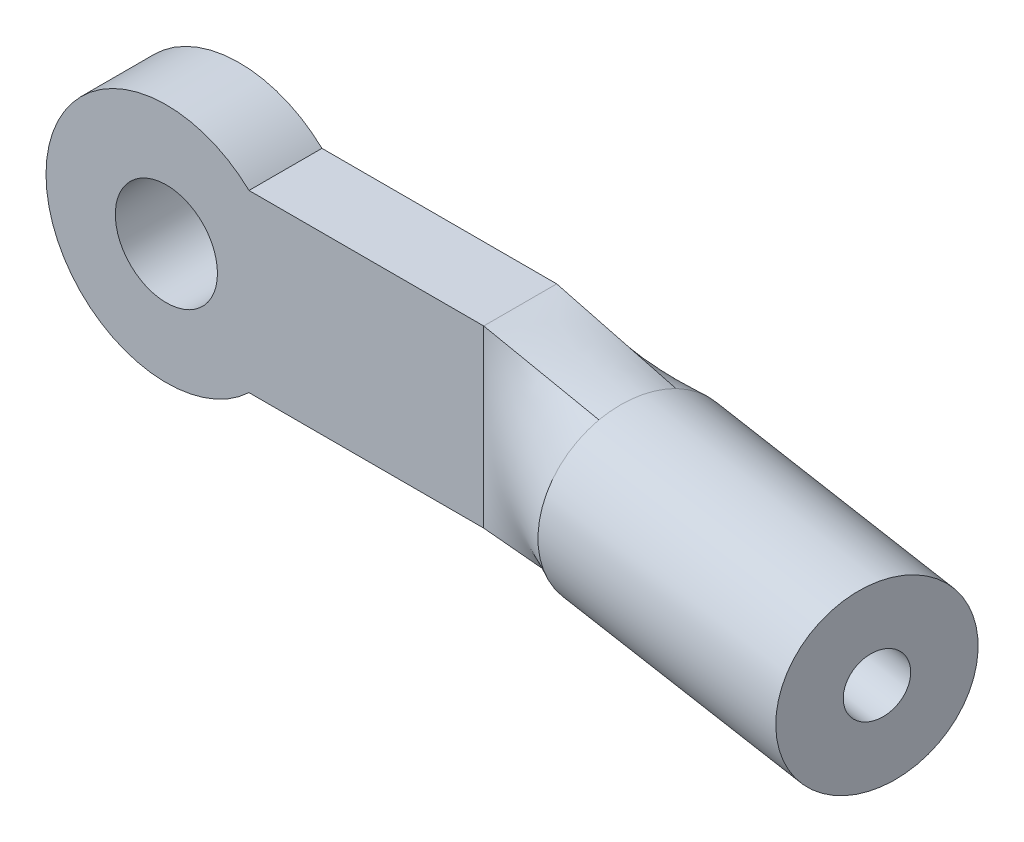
ISO-10303-21;
HEADER;
FILE_DESCRIPTION(('STEP AP214'),'2;1');
FILE_NAME('part.step','',(''),(''),'','','');
FILE_SCHEMA(('AUTOMOTIVE_DESIGN { 1 0 10303 214 1 1 1 1 }'));
ENDSEC;
DATA;
#1=APPLICATION_CONTEXT('core data for automotive mechanical design processes');
#2=APPLICATION_PROTOCOL_DEFINITION('international standard','automotive_design',2000,#1);
#3=PRODUCT_CONTEXT('',#1,'mechanical');
#4=PRODUCT('Part','Part','',(#3));
#5=PRODUCT_RELATED_PRODUCT_CATEGORY('part','',(#4));
#6=PRODUCT_DEFINITION_FORMATION('','',#4);
#7=PRODUCT_DEFINITION_CONTEXT('part definition',#1,'design');
#8=PRODUCT_DEFINITION('design','',#6,#7);
#9=PRODUCT_DEFINITION_SHAPE('','',#8);
#10=(LENGTH_UNIT() NAMED_UNIT(*) SI_UNIT(.MILLI.,.METRE.));
#11=(NAMED_UNIT(*) PLANE_ANGLE_UNIT() SI_UNIT($,.RADIAN.));
#12=(NAMED_UNIT(*) SI_UNIT($,.STERADIAN.) SOLID_ANGLE_UNIT());
#13=UNCERTAINTY_MEASURE_WITH_UNIT(LENGTH_MEASURE(1.E-05),#10,'distance_accuracy_value','');
#14=(GEOMETRIC_REPRESENTATION_CONTEXT(3) GLOBAL_UNCERTAINTY_ASSIGNED_CONTEXT((#13)) GLOBAL_UNIT_ASSIGNED_CONTEXT((#10,
#11,#12)) REPRESENTATION_CONTEXT('',''));
#15=CARTESIAN_POINT('',(0.,0.,0.));
#16=DIRECTION('',(0.,0.,1.));
#17=DIRECTION('',(1.,0.,0.));
#18=AXIS2_PLACEMENT_3D('',#15,#16,#17);
#19=CARTESIAN_POINT('',(0.,0.,0.5));
#20=DIRECTION('',(0.,0.,-1.));
#21=DIRECTION('',(-1.,0.,0.));
#22=AXIS2_PLACEMENT_3D('',#19,#20,#21);
#23=CYLINDRICAL_SURFACE('',#22,1.65);
#24=CARTESIAN_POINT('',(0.,0.,-0.5));
#25=DIRECTION('',(0.,0.,1.));
#26=DIRECTION('',(1.,0.,0.));
#27=AXIS2_PLACEMENT_3D('',#24,#25,#26);
#28=CIRCLE('',#27,1.65);
#29=CARTESIAN_POINT('',(1.13247516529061,1.2,-0.5));
#30=VERTEX_POINT('',#29);
#31=CARTESIAN_POINT('',(1.13247516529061,-1.2,-0.5));
#32=VERTEX_POINT('',#31);
#33=EDGE_CURVE('E117',#30,#32,#28,.T.);
#34=ORIENTED_EDGE('',*,*,#33,.T.);
#35=DIRECTION('',(0.,0.,-1.));
#36=VECTOR('',#35,1.);
#37=CARTESIAN_POINT('',(1.13247516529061,-1.2,0.5));
#38=LINE('',#37,#36);
#39=CARTESIAN_POINT('',(1.13247516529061,-1.2,0.5));
#40=VERTEX_POINT('',#39);
#41=EDGE_CURVE('E12',#40,#32,#38,.T.);
#42=ORIENTED_EDGE('',*,*,#41,.F.);
#43=CARTESIAN_POINT('',(0.,0.,0.5));
#44=DIRECTION('',(0.,0.,1.));
#45=DIRECTION('',(1.,0.,0.));
#46=AXIS2_PLACEMENT_3D('',#43,#44,#45);
#47=CIRCLE('',#46,1.65);
#48=CARTESIAN_POINT('',(1.13247516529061,1.2,0.5));
#49=VERTEX_POINT('',#48);
#50=EDGE_CURVE('E105',#49,#40,#47,.T.);
#51=ORIENTED_EDGE('',*,*,#50,.F.);
#52=DIRECTION('',(0.,0.,-1.));
#53=VECTOR('',#52,1.);
#54=CARTESIAN_POINT('',(1.13247516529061,1.2,0.5));
#55=LINE('',#54,#53);
#56=EDGE_CURVE('E79',#49,#30,#55,.T.);
#57=ORIENTED_EDGE('',*,*,#56,.T.);
#58=EDGE_LOOP('',(#34,#42,#51,#57));
#59=FACE_BOUND('',#58,.T.);
#60=ADVANCED_FACE('F60',(#59),#23,.T.);
#61=CARTESIAN_POINT('',(1.20740101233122,-1.2,0.5));
#62=DIRECTION('',(0.,-1.,0.));
#63=DIRECTION('',(1.,0.,0.));
#64=AXIS2_PLACEMENT_3D('',#61,#62,#63);
#65=PLANE('',#64);
#66=DIRECTION('',(-1.,0.,0.));
#67=VECTOR('',#66,1.);
#68=CARTESIAN_POINT('',(1.20740101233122,-1.2,-0.5));
#69=LINE('',#68,#67);
#70=CARTESIAN_POINT('',(4.34999999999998,-1.2,-0.500000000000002));
#71=VERTEX_POINT('',#70);
#72=EDGE_CURVE('E125',#71,#32,#69,.T.);
#73=ORIENTED_EDGE('',*,*,#72,.F.);
#74=DIRECTION('',(0.,0.,1.));
#75=VECTOR('',#74,1.);
#76=CARTESIAN_POINT('',(4.35,-1.2,0.5));
#77=LINE('',#76,#75);
#78=CARTESIAN_POINT('',(4.35000000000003,-1.2,0.500000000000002));
#79=VERTEX_POINT('',#78);
#80=EDGE_CURVE('E70',#79,#71,#77,.F.);
#81=ORIENTED_EDGE('',*,*,#80,.F.);
#82=DIRECTION('',(-1.,0.,0.));
#83=VECTOR('',#82,1.);
#84=CARTESIAN_POINT('',(1.20740101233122,-1.2,0.5));
#85=LINE('',#84,#83);
#86=EDGE_CURVE('E109',#79,#40,#85,.T.);
#87=ORIENTED_EDGE('',*,*,#86,.T.);
#88=ORIENTED_EDGE('',*,*,#41,.T.);
#89=EDGE_LOOP('',(#73,#81,#87,#88));
#90=FACE_BOUND('',#89,.T.);
#91=ADVANCED_FACE('F119',(#90),#65,.T.);
#92=CARTESIAN_POINT('',(1.20740101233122,1.2,0.5));
#93=DIRECTION('',(0.,1.,0.));
#94=DIRECTION('',(-1.,0.,0.));
#95=AXIS2_PLACEMENT_3D('',#92,#93,#94);
#96=PLANE('',#95);
#97=DIRECTION('',(1.,0.,0.));
#98=VECTOR('',#97,1.);
#99=CARTESIAN_POINT('',(1.20740101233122,1.2,-0.5));
#100=LINE('',#99,#98);
#101=CARTESIAN_POINT('',(4.35000000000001,1.2,-0.499999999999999));
#102=VERTEX_POINT('',#101);
#103=EDGE_CURVE('E128',#30,#102,#100,.T.);
#104=ORIENTED_EDGE('',*,*,#103,.F.);
#105=ORIENTED_EDGE('',*,*,#56,.F.);
#106=DIRECTION('',(1.,0.,0.));
#107=VECTOR('',#106,1.);
#108=CARTESIAN_POINT('',(1.20740101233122,1.2,0.5));
#109=LINE('',#108,#107);
#110=CARTESIAN_POINT('',(4.35000000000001,1.2,0.500000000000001));
#111=VERTEX_POINT('',#110);
#112=EDGE_CURVE('E111',#49,#111,#109,.T.);
#113=ORIENTED_EDGE('',*,*,#112,.T.);
#114=DIRECTION('',(0.,0.,1.));
#115=VECTOR('',#114,1.);
#116=CARTESIAN_POINT('',(4.35,1.2,0.5));
#117=LINE('',#116,#115);
#118=EDGE_CURVE('E133',#111,#102,#117,.F.);
#119=ORIENTED_EDGE('',*,*,#118,.T.);
#120=EDGE_LOOP('',(#104,#105,#113,#119));
#121=FACE_BOUND('',#120,.T.);
#122=ADVANCED_FACE('F249',(#121),#96,.T.);
#123=CARTESIAN_POINT('',(0.,0.,0.5));
#124=DIRECTION('',(0.,0.,-1.));
#125=DIRECTION('',(-1.,0.,0.));
#126=AXIS2_PLACEMENT_3D('',#123,#124,#125);
#127=CYLINDRICAL_SURFACE('',#126,0.7);
#128=CARTESIAN_POINT('',(0.,0.,0.5));
#129=DIRECTION('',(0.,0.,1.));
#130=DIRECTION('',(1.,0.,0.));
#131=AXIS2_PLACEMENT_3D('',#128,#129,#130);
#132=CIRCLE('',#131,0.7);
#133=CARTESIAN_POINT('',(0.7,0.,0.5));
#134=VERTEX_POINT('',#133);
#135=EDGE_CURVE('E127',#134,#134,#132,.T.);
#136=ORIENTED_EDGE('',*,*,#135,.T.);
#137=EDGE_LOOP('',(#136));
#138=FACE_BOUND('',#137,.T.);
#139=CARTESIAN_POINT('',(0.,0.,-0.5));
#140=DIRECTION('',(0.,0.,1.));
#141=DIRECTION('',(1.,0.,0.));
#142=AXIS2_PLACEMENT_3D('',#139,#140,#141);
#143=CIRCLE('',#142,0.7);
#144=CARTESIAN_POINT('',(0.7,0.,-0.5));
#145=VERTEX_POINT('',#144);
#146=EDGE_CURVE('E113',#145,#145,#143,.T.);
#147=ORIENTED_EDGE('',*,*,#146,.F.);
#148=EDGE_LOOP('',(#147));
#149=FACE_BOUND('',#148,.T.);
#150=ADVANCED_FACE('F296',(#138,#149),#127,.F.);
#151=CARTESIAN_POINT('',(1.20740101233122,-5.6496965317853,0.5));
#152=DIRECTION('',(0.,0.,1.));
#153=DIRECTION('',(1.,0.,0.));
#154=AXIS2_PLACEMENT_3D('',#151,#152,#153);
#155=PLANE('',#154);
#156=ORIENTED_EDGE('',*,*,#50,.T.);
#157=ORIENTED_EDGE('',*,*,#86,.F.);
#158=DIRECTION('',(0.,1.,0.));
#159=VECTOR('',#158,1.);
#160=CARTESIAN_POINT('',(4.35,-5.6496965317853,0.5));
#161=LINE('',#160,#159);
#162=EDGE_CURVE('E120',#111,#79,#161,.F.);
#163=ORIENTED_EDGE('',*,*,#162,.F.);
#164=ORIENTED_EDGE('',*,*,#112,.F.);
#165=EDGE_LOOP('',(#156,#157,#163,#164));
#166=FACE_BOUND('',#165,.T.);
#167=ORIENTED_EDGE('',*,*,#135,.F.);
#168=EDGE_LOOP('',(#167));
#169=FACE_BOUND('',#168,.T.);
#170=ADVANCED_FACE('F107',(#166,#169),#155,.T.);
#171=CARTESIAN_POINT('',(1.20740101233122,-5.6496965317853,-0.5));
#172=DIRECTION('',(0.,0.,1.));
#173=DIRECTION('',(1.,0.,0.));
#174=AXIS2_PLACEMENT_3D('',#171,#172,#173);
#175=PLANE('',#174);
#176=ORIENTED_EDGE('',*,*,#33,.F.);
#177=ORIENTED_EDGE('',*,*,#103,.T.);
#178=DIRECTION('',(0.,1.,0.));
#179=VECTOR('',#178,1.);
#180=CARTESIAN_POINT('',(4.35,-5.6496965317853,-0.5));
#181=LINE('',#180,#179);
#182=EDGE_CURVE('E131',#102,#71,#181,.F.);
#183=ORIENTED_EDGE('',*,*,#182,.T.);
#184=ORIENTED_EDGE('',*,*,#72,.T.);
#185=EDGE_LOOP('',(#176,#177,#183,#184));
#186=FACE_BOUND('',#185,.T.);
#187=ORIENTED_EDGE('',*,*,#146,.T.);
#188=EDGE_LOOP('',(#187));
#189=FACE_BOUND('',#188,.T.);
#190=ADVANCED_FACE('F246',(#186,#189),#175,.F.);
#191=CARTESIAN_POINT('',(6.42545701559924,-1.05900389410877,-0.104828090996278));
#192=CARTESIAN_POINT('',(4.35,-1.2,-0.5));
#193=CARTESIAN_POINT('',(6.40296877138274,-1.11680972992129,0.033905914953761));
#194=CARTESIAN_POINT('',(4.35,-1.2,-0.333333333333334));
#195=CARTESIAN_POINT('',(6.37697342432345,-1.14913958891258,0.189170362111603));
#196=CARTESIAN_POINT('',(4.35,-1.2,-0.166666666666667));
#197=CARTESIAN_POINT('',(6.32322412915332,-1.14933786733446,0.50033737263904));
#198=CARTESIAN_POINT('',(4.35,-1.2,0.166666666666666));
#199=CARTESIAN_POINT('',(6.29562127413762,-1.11720572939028,0.655365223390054));
#200=CARTESIAN_POINT('',(4.35,-1.2,0.333333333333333));
#201=CARTESIAN_POINT('',(6.2702543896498,-1.0595764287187,0.793675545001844));
#202=CARTESIAN_POINT('',(4.35,-1.2,0.5));
#203=B_SPLINE_SURFACE_WITH_KNOTS('',3,1,((#191,#192),(#193,#194),(#195,#196),(#197,#198),(#199,
#200),(#201,#202)),.UNSPECIFIED.,.F.,.F.,.F.,(4,2,4),(2,2),(0.,0.5,1.),(0.,1.),.UNSPECIFIED.);
#204=CARTESIAN_POINT('',(6.32018352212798,0.0503802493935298,0.34035087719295));
#205=DIRECTION('',(-0.985091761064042,-0.0251901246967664,-0.170175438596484));
#206=DIRECTION('',(-0.170229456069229,0.,0.985404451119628));
#207=AXIS2_PLACEMENT_3D('',#204,#205,#206);
#208=CIRCLE('',#207,1.2);
#209=CARTESIAN_POINT('',(6.42562151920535,-1.06074381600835,-0.105522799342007));
#210=VERTEX_POINT('',#209);
#211=CARTESIAN_POINT('',(6.27017603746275,-1.06131691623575,0.794386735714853));
#212=VERTEX_POINT('',#211);
#213=EDGE_CURVE('E140',#210,#212,#208,.T.);
#214=DIRECTION('',(-0.985933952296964,-0.0720989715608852,-0.150784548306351));
#215=VECTOR('',#214,1.);
#216=CARTESIAN_POINT('',(5.3101271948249,-1.12978821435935,0.646837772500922));
#217=LINE('',#216,#215);
#218=EDGE_CURVE('E154',#212,#79,#217,.T.);
#219=DIRECTION('',(0.980171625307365,0.0665879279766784,0.186626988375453));
#220=VECTOR('',#219,1.);
#221=CARTESIAN_POINT('',(5.38772850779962,-1.12950194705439,-0.302414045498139));
#222=LINE('',#221,#220);
#223=EDGE_CURVE('E164',#71,#210,#222,.T.);
#224=ORIENTED_EDGE('',*,*,#213,.T.);
#225=ORIENTED_EDGE('',*,*,#218,.T.);
#226=ORIENTED_EDGE('',*,*,#80,.T.);
#227=ORIENTED_EDGE('',*,*,#223,.T.);
#228=EDGE_LOOP('',(#224,#225,#226,#227));
#229=FACE_BOUND('',#228,.T.);
#230=ADVANCED_FACE('F206',(#229),#203,.T.);
#231=CARTESIAN_POINT('',(6.2702543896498,-1.0595764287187,0.793675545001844));
#232=CARTESIAN_POINT('',(4.35,-1.2,0.5));
#233=CARTESIAN_POINT('',(6.25481376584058,-1.02449792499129,0.877863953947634));
#234=CARTESIAN_POINT('',(4.35,-1.1,0.5));
#235=CARTESIAN_POINT('',(6.23857381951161,-0.976685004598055,0.964794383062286));
#236=CARTESIAN_POINT('',(4.35,-0.999999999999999,0.5));
#237=CARTESIAN_POINT('',(6.20614962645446,-0.849167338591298,1.13361204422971));
#238=CARTESIAN_POINT('',(4.35,-0.799999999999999,0.5));
#239=CARTESIAN_POINT('',(6.1899738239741,-0.769268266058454,1.21542163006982));
#240=CARTESIAN_POINT('',(4.35,-0.699999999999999,0.5));
#241=CARTESIAN_POINT('',(6.16045116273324,-0.57705447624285,1.35786663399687));
#242=CARTESIAN_POINT('',(4.35,-0.499999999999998,0.5));
#243=CARTESIAN_POINT('',(6.14714923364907,-0.464641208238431,1.41822738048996));
#244=CARTESIAN_POINT('',(4.35,-0.399999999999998,0.5));
#245=CARTESIAN_POINT('',(6.12652953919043,-0.21821046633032,1.50111049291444));
#246=CARTESIAN_POINT('',(4.35,-0.199999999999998,0.5));
#247=CARTESIAN_POINT('',(6.11926916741,-0.0843991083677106,1.52333113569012));
#248=CARTESIAN_POINT('',(4.35,-0.0999999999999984,0.5));
#249=CARTESIAN_POINT('',(6.11258468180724,0.183652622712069,1.52234729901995));
#250=CARTESIAN_POINT('',(4.35,0.100000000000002,0.5));
#251=CARTESIAN_POINT('',(6.11317054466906,0.317492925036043,1.49914428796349));
#252=CARTESIAN_POINT('',(4.35,0.200000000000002,0.5));
#253=CARTESIAN_POINT('',(6.1214969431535,0.564030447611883,1.41445182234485));
#254=CARTESIAN_POINT('',(4.35,0.400000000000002,0.5));
#255=CARTESIAN_POINT('',(6.1291903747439,0.676521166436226,1.35326560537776));
#256=CARTESIAN_POINT('',(4.35,0.500000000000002,0.5));
#257=CARTESIAN_POINT('',(6.14912190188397,0.868917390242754,1.2094089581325));
#258=CARTESIAN_POINT('',(4.35,0.700000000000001,0.5));
#259=CARTESIAN_POINT('',(6.16131016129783,0.948921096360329,1.12701247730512));
#260=CARTESIAN_POINT('',(4.35,0.800000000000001,0.5));
#261=CARTESIAN_POINT('',(6.18736908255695,1.07665450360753,0.957257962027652));
#262=CARTESIAN_POINT('',(4.35,1.,0.5));
#263=CARTESIAN_POINT('',(6.2012216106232,1.12457843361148,0.869976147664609));
#264=CARTESIAN_POINT('',(4.35,1.1,0.5));
#265=CARTESIAN_POINT('',(6.21491002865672,1.15976439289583,0.785529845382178));
#266=CARTESIAN_POINT('',(4.35,1.2,0.5));
#267=B_SPLINE_SURFACE_WITH_KNOTS('',3,1,((#231,#232),(#233,#234),(#235,#236),(#237,#238),(#239,
#240),(#241,#242),(#243,#244),(#245,#246),(#247,#248),(#249,#250),(#251,#252),(#253,#254),(#255,
#256),(#257,#258),(#259,#260),(#261,#262),(#263,#264),(#265,#266)),.UNSPECIFIED.,.F.,.F.,.F.,(4,
2,2,2,2,2,2,2,4),(2,2),(0.,0.125,0.25,0.375,0.5,0.625,0.75,0.875,1.),(0.,1.),.UNSPECIFIED.);
#268=CARTESIAN_POINT('',(6.21474552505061,1.16150431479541,0.786224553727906));
#269=VERTEX_POINT('',#268);
#270=EDGE_CURVE('E137',#212,#269,#208,.T.);
#271=DIRECTION('',(-0.988256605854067,0.0213217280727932,-0.151308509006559));
#272=VECTOR('',#271,1.);
#273=CARTESIAN_POINT('',(5.28245501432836,1.17988219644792,0.642764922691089));
#274=LINE('',#273,#272);
#275=EDGE_CURVE('E168',#269,#111,#274,.T.);
#276=ORIENTED_EDGE('',*,*,#270,.T.);
#277=ORIENTED_EDGE('',*,*,#275,.T.);
#278=ORIENTED_EDGE('',*,*,#162,.T.);
#279=ORIENTED_EDGE('',*,*,#218,.F.);
#280=EDGE_LOOP('',(#276,#277,#278,#279));
#281=FACE_BOUND('',#280,.T.);
#282=ADVANCED_FACE('F193',(#281),#267,.T.);
#283=CARTESIAN_POINT('',(6.37011265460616,1.16033692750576,-0.112973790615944));
#284=CARTESIAN_POINT('',(4.35,1.2,-0.5));
#285=CARTESIAN_POINT('',(6.38555327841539,1.12525842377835,-0.197162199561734));
#286=CARTESIAN_POINT('',(4.35,1.1,-0.5));
#287=CARTESIAN_POINT('',(6.40179322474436,1.07744550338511,-0.284092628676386));
#288=CARTESIAN_POINT('',(4.35,0.999999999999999,-0.5));
#289=CARTESIAN_POINT('',(6.4342174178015,0.949927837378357,-0.452910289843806));
#290=CARTESIAN_POINT('',(4.35,0.799999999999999,-0.5));
#291=CARTESIAN_POINT('',(6.45039322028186,0.870028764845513,-0.534719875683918));
#292=CARTESIAN_POINT('',(4.35,0.699999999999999,-0.5));
#293=CARTESIAN_POINT('',(6.47991588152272,0.677814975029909,-0.677164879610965));
#294=CARTESIAN_POINT('',(4.35,0.499999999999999,-0.5));
#295=CARTESIAN_POINT('',(6.49321781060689,0.56540170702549,-0.737525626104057));
#296=CARTESIAN_POINT('',(4.35,0.399999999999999,-0.5));
#297=CARTESIAN_POINT('',(6.51383750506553,0.318970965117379,-0.820408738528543));
#298=CARTESIAN_POINT('',(4.35,0.199999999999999,-0.5));
#299=CARTESIAN_POINT('',(6.52109787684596,0.18515960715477,-0.842629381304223));
#300=CARTESIAN_POINT('',(4.35,0.0999999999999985,-0.5));
#301=CARTESIAN_POINT('',(6.52778236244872,-0.0828921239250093,-0.841645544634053));
#302=CARTESIAN_POINT('',(4.35,-0.100000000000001,-0.5));
#303=CARTESIAN_POINT('',(6.5271964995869,-0.216732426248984,-0.818442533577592));
#304=CARTESIAN_POINT('',(4.35,-0.200000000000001,-0.5));
#305=CARTESIAN_POINT('',(6.51887010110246,-0.463269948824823,-0.733750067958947));
#306=CARTESIAN_POINT('',(4.35,-0.400000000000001,-0.5));
#307=CARTESIAN_POINT('',(6.51117666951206,-0.575760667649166,-0.672563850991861));
#308=CARTESIAN_POINT('',(4.35,-0.500000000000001,-0.5));
#309=CARTESIAN_POINT('',(6.49124514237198,-0.768156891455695,-0.528707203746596));
#310=CARTESIAN_POINT('',(4.35,-0.700000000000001,-0.5));
#311=CARTESIAN_POINT('',(6.47905688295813,-0.84816059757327,-0.44631072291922));
#312=CARTESIAN_POINT('',(4.35,-0.800000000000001,-0.5));
#313=CARTESIAN_POINT('',(6.452997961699,-0.975894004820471,-0.276556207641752));
#314=CARTESIAN_POINT('',(4.35,-1.,-0.5));
#315=CARTESIAN_POINT('',(6.43914543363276,-1.02381793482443,-0.189274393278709));
#316=CARTESIAN_POINT('',(4.35,-1.1,-0.5));
#317=CARTESIAN_POINT('',(6.42545701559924,-1.05900389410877,-0.104828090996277));
#318=CARTESIAN_POINT('',(4.35,-1.2,-0.5));
#319=B_SPLINE_SURFACE_WITH_KNOTS('',3,1,((#283,#284),(#285,#286),(#287,#288),(#289,#290),(#291,
#292),(#293,#294),(#295,#296),(#297,#298),(#299,#300),(#301,#302),(#303,#304),(#305,#306),(#307,
#308),(#309,#310),(#311,#312),(#313,#314),(#315,#316),(#317,#318)),.UNSPECIFIED.,.F.,.F.,.F.,(4,
2,2,2,2,2,2,2,4),(2,2),(0.,0.125,0.25,0.375,0.5,0.625,0.75,0.875,1.),(0.,1.),.UNSPECIFIED.);
#320=CARTESIAN_POINT('',(6.37019100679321,1.16207741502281,-0.113684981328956));
#321=VERTEX_POINT('',#320);
#322=EDGE_CURVE('E152',#321,#210,#208,.T.);
#323=DIRECTION('',(-0.981955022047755,0.0192797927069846,-0.18812927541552));
#324=VECTOR('',#323,1.);
#325=CARTESIAN_POINT('',(5.36005632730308,1.18016846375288,-0.306486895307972));
#326=LINE('',#325,#324);
#327=EDGE_CURVE('E177',#321,#102,#326,.T.);
#328=ORIENTED_EDGE('',*,*,#322,.T.);
#329=ORIENTED_EDGE('',*,*,#223,.F.);
#330=ORIENTED_EDGE('',*,*,#182,.F.);
#331=ORIENTED_EDGE('',*,*,#327,.F.);
#332=EDGE_LOOP('',(#328,#329,#330,#331));
#333=FACE_BOUND('',#332,.T.);
#334=ADVANCED_FACE('F205',(#333),#319,.T.);
#335=CARTESIAN_POINT('',(6.21491002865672,1.15976439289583,0.785529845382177));
#336=CARTESIAN_POINT('',(4.35,1.2,0.5));
#337=CARTESIAN_POINT('',(6.23739827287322,1.21757022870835,0.646795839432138));
#338=CARTESIAN_POINT('',(4.35,1.2,0.333333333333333));
#339=CARTESIAN_POINT('',(6.26339361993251,1.24990008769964,0.491531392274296));
#340=CARTESIAN_POINT('',(4.35,1.2,0.166666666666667));
#341=CARTESIAN_POINT('',(6.31714291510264,1.25009836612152,0.180364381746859));
#342=CARTESIAN_POINT('',(4.35,1.2,-0.166666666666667));
#343=CARTESIAN_POINT('',(6.34474577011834,1.21796622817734,0.0253365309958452));
#344=CARTESIAN_POINT('',(4.35,1.2,-0.333333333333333));
#345=CARTESIAN_POINT('',(6.37011265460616,1.16033692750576,-0.112973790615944));
#346=CARTESIAN_POINT('',(4.35,1.2,-0.5));
#347=B_SPLINE_SURFACE_WITH_KNOTS('',3,1,((#335,#336),(#337,#338),(#339,#340),(#341,#342),(#343,
#344),(#345,#346)),.UNSPECIFIED.,.F.,.F.,.F.,(4,2,4),(2,2),(0.,0.5,1.),(0.,1.),.UNSPECIFIED.);
#348=EDGE_CURVE('E63',#269,#321,#208,.T.);
#349=ORIENTED_EDGE('',*,*,#348,.T.);
#350=ORIENTED_EDGE('',*,*,#327,.T.);
#351=ORIENTED_EDGE('',*,*,#118,.F.);
#352=ORIENTED_EDGE('',*,*,#275,.F.);
#353=EDGE_LOOP('',(#349,#350,#351,#352));
#354=FACE_BOUND('',#353,.T.);
#355=ADVANCED_FACE('F221',(#354),#347,.T.);
#356=CARTESIAN_POINT('',(6.32018352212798,0.0503802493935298,0.34035087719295));
#357=DIRECTION('',(0.985091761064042,0.0251901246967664,0.170175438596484));
#358=DIRECTION('',(0.170229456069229,0.,-0.985404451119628));
#359=AXIS2_PLACEMENT_3D('',#356,#357,#358);
#360=CYLINDRICAL_SURFACE('',#359,1.2);
#361=ORIENTED_EDGE('',*,*,#348,.F.);
#362=ORIENTED_EDGE('',*,*,#270,.F.);
#363=ORIENTED_EDGE('',*,*,#213,.F.);
#364=ORIENTED_EDGE('',*,*,#322,.F.);
#365=EDGE_LOOP('',(#361,#362,#363,#364));
#366=FACE_BOUND('',#365,.T.);
#367=CARTESIAN_POINT('',(10.2605505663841,0.151140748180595,1.02105263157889));
#368=DIRECTION('',(-0.985091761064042,-0.0251901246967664,-0.170175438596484));
#369=DIRECTION('',(-0.170229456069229,0.,0.985404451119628));
#370=AXIS2_PLACEMENT_3D('',#367,#368,#369);
#371=CIRCLE('',#370,1.2);
#372=CARTESIAN_POINT('',(10.0562752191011,0.151140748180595,2.20353797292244));
#373=VERTEX_POINT('',#372);
#374=EDGE_CURVE('E182',#373,#373,#371,.T.);
#375=ORIENTED_EDGE('',*,*,#374,.T.);
#376=EDGE_LOOP('',(#375));
#377=FACE_BOUND('',#376,.T.);
#378=ADVANCED_FACE('F256',(#366,#377),#360,.T.);
#379=CARTESIAN_POINT('',(10.2605505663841,0.151140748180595,1.02105263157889));
#380=DIRECTION('',(-0.985091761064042,-0.0251901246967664,-0.170175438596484));
#381=DIRECTION('',(-0.170229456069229,0.,0.985404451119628));
#382=AXIS2_PLACEMENT_3D('',#379,#380,#381);
#383=PLANE('',#382);
#384=CARTESIAN_POINT('',(10.2605505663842,0.151140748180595,1.02105263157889));
#385=DIRECTION('',(0.985091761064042,0.0251901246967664,0.170175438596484));
#386=DIRECTION('',(0.170229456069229,0.,-0.985404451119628));
#387=AXIS2_PLACEMENT_3D('',#384,#385,#386);
#388=CIRCLE('',#387,0.4);
#389=CARTESIAN_POINT('',(10.3286423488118,0.151140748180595,0.626890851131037));
#390=VERTEX_POINT('',#389);
#391=EDGE_CURVE('E395',#390,#390,#388,.T.);
#392=ORIENTED_EDGE('',*,*,#391,.F.);
#393=EDGE_LOOP('',(#392));
#394=FACE_BOUND('',#393,.T.);
#395=ORIENTED_EDGE('',*,*,#374,.F.);
#396=EDGE_LOOP('',(#395));
#397=FACE_BOUND('',#396,.T.);
#398=ADVANCED_FACE('F275',(#394,#397),#383,.F.);
#399=CARTESIAN_POINT('',(4.3499999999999,0.,0.));
#400=DIRECTION('',(0.985091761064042,0.0251901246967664,0.170175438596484));
#401=DIRECTION('',(0.170229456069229,0.,-0.985404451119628));
#402=AXIS2_PLACEMENT_3D('',#399,#400,#401);
#403=CYLINDRICAL_SURFACE('',#402,0.4);
#404=CARTESIAN_POINT('',(4.3499999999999,0.,0.));
#405=DIRECTION('',(0.985091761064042,0.0251901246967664,0.170175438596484));
#406=DIRECTION('',(0.170229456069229,0.,-0.985404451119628));
#407=AXIS2_PLACEMENT_3D('',#404,#405,#406);
#408=CIRCLE('',#407,0.4);
#409=CARTESIAN_POINT('',(4.41809178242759,0.,-0.394161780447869));
#410=VERTEX_POINT('',#409);
#411=EDGE_CURVE('E394',#410,#410,#408,.T.);
#412=ORIENTED_EDGE('',*,*,#411,.F.);
#413=EDGE_LOOP('',(#412));
#414=FACE_BOUND('',#413,.T.);
#415=ORIENTED_EDGE('',*,*,#391,.T.);
#416=EDGE_LOOP('',(#415));
#417=FACE_BOUND('',#416,.T.);
#418=ADVANCED_FACE('F278',(#414,#417),#403,.F.);
#419=CARTESIAN_POINT('',(4.3499999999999,0.,0.));
#420=DIRECTION('',(0.985091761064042,0.0251901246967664,0.170175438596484));
#421=DIRECTION('',(0.170229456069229,0.,-0.985404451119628));
#422=AXIS2_PLACEMENT_3D('',#419,#420,#421);
#423=PLANE('',#422);
#424=ORIENTED_EDGE('',*,*,#411,.T.);
#425=EDGE_LOOP('',(#424));
#426=FACE_BOUND('',#425,.T.);
#427=ADVANCED_FACE('F282',(#426),#423,.T.);
#428=CLOSED_SHELL('',(#60,#91,#122,#150,#170,#190,#230,#282,#334,#355,#378,#398,#418,#427));
#429=MANIFOLD_SOLID_BREP('B2',#428);
#430=ADVANCED_BREP_SHAPE_REPRESENTATION('',(#18,#429),#14);
#431=SHAPE_DEFINITION_REPRESENTATION(#9,#430);
ENDSEC;
END-ISO-10303-21;
